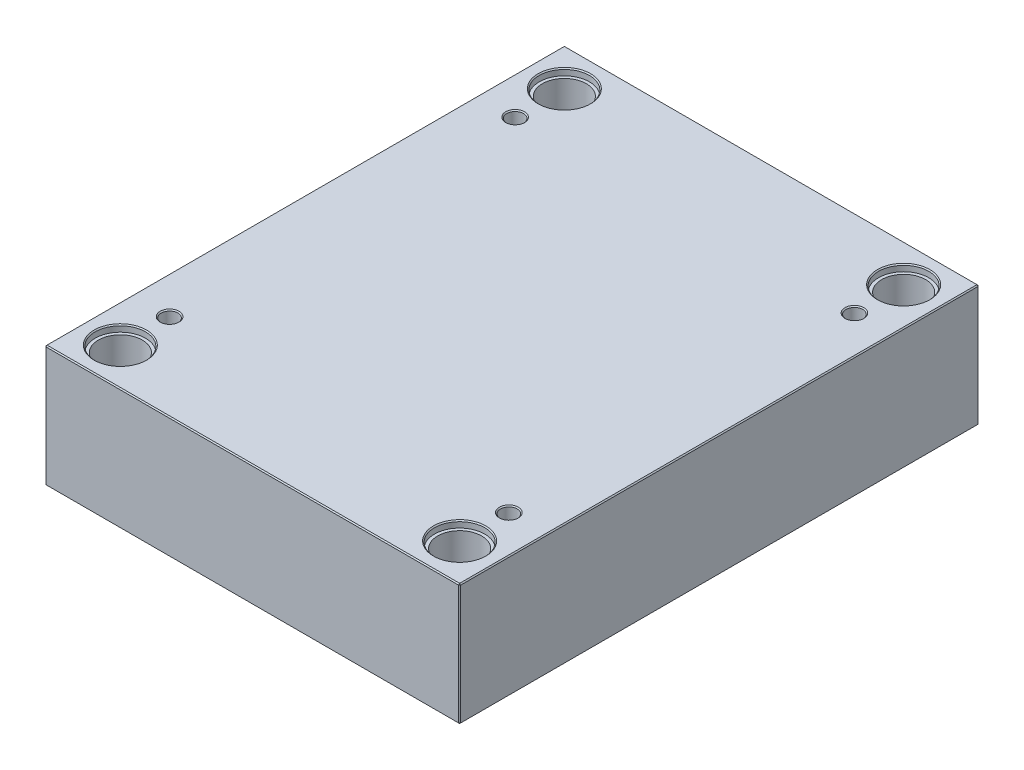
ISO-10303-21;
HEADER;
FILE_DESCRIPTION(('STEP AP214'),'2;1');
FILE_NAME('part.step','',(''),(''),'','','');
FILE_SCHEMA(('AUTOMOTIVE_DESIGN { 1 0 10303 214 1 1 1 1 }'));
ENDSEC;
DATA;
#1=APPLICATION_CONTEXT('core data for automotive mechanical design processes');
#2=APPLICATION_PROTOCOL_DEFINITION('international standard','automotive_design',2000,#1);
#3=PRODUCT_CONTEXT('',#1,'mechanical');
#4=PRODUCT('Part','Part','',(#3));
#5=PRODUCT_RELATED_PRODUCT_CATEGORY('part','',(#4));
#6=PRODUCT_DEFINITION_FORMATION('','',#4);
#7=PRODUCT_DEFINITION_CONTEXT('part definition',#1,'design');
#8=PRODUCT_DEFINITION('design','',#6,#7);
#9=PRODUCT_DEFINITION_SHAPE('','',#8);
#10=(LENGTH_UNIT() NAMED_UNIT(*) SI_UNIT(.MILLI.,.METRE.));
#11=(NAMED_UNIT(*) PLANE_ANGLE_UNIT() SI_UNIT($,.RADIAN.));
#12=(NAMED_UNIT(*) SI_UNIT($,.STERADIAN.) SOLID_ANGLE_UNIT());
#13=UNCERTAINTY_MEASURE_WITH_UNIT(LENGTH_MEASURE(1.E-05),#10,'distance_accuracy_value','');
#14=(GEOMETRIC_REPRESENTATION_CONTEXT(3) GLOBAL_UNCERTAINTY_ASSIGNED_CONTEXT((#13)) GLOBAL_UNIT_ASSIGNED_CONTEXT((#10,
#11,#12)) REPRESENTATION_CONTEXT('',''));
#15=CARTESIAN_POINT('',(0.,0.,0.));
#16=DIRECTION('',(0.,0.,1.));
#17=DIRECTION('',(1.,0.,0.));
#18=AXIS2_PLACEMENT_3D('',#15,#16,#17);
#19=CARTESIAN_POINT('',(-162.,0.,-212.));
#20=DIRECTION('',(0.,1.,0.));
#21=DIRECTION('',(0.,0.,1.));
#22=AXIS2_PLACEMENT_3D('',#19,#20,#21);
#23=CYLINDRICAL_SURFACE('',#22,21.);
#24=CARTESIAN_POINT('',(-162.,0.999999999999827,-212.));
#25=DIRECTION('',(0.,1.,0.));
#26=DIRECTION('',(0.,0.,1.));
#27=AXIS2_PLACEMENT_3D('',#24,#25,#26);
#28=CIRCLE('',#27,21.);
#29=CARTESIAN_POINT('',(-162.,0.999999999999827,-191.));
#30=VERTEX_POINT('',#29);
#31=EDGE_CURVE('E472',#30,#30,#28,.F.);
#32=ORIENTED_EDGE('',*,*,#31,.T.);
#33=EDGE_LOOP('',(#32));
#34=FACE_BOUND('',#33,.T.);
#35=CARTESIAN_POINT('',(-162.,109.7,-212.));
#36=DIRECTION('',(0.,1.,0.));
#37=DIRECTION('',(0.,0.,1.));
#38=AXIS2_PLACEMENT_3D('',#35,#36,#37);
#39=CIRCLE('',#38,21.);
#40=CARTESIAN_POINT('',(-162.,109.7,-191.));
#41=VERTEX_POINT('',#40);
#42=EDGE_CURVE('E221',#41,#41,#39,.F.);
#43=ORIENTED_EDGE('',*,*,#42,.F.);
#44=EDGE_LOOP('',(#43));
#45=FACE_BOUND('',#44,.T.);
#46=ADVANCED_FACE('F16',(#34,#45),#23,.F.);
#47=CARTESIAN_POINT('',(162.,0.,-212.));
#48=DIRECTION('',(0.,1.,0.));
#49=DIRECTION('',(0.,0.,1.));
#50=AXIS2_PLACEMENT_3D('',#47,#48,#49);
#51=CYLINDRICAL_SURFACE('',#50,21.);
#52=CARTESIAN_POINT('',(162.,0.999999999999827,-212.));
#53=DIRECTION('',(0.,1.,0.));
#54=DIRECTION('',(0.,0.,1.));
#55=AXIS2_PLACEMENT_3D('',#52,#53,#54);
#56=CIRCLE('',#55,21.);
#57=CARTESIAN_POINT('',(162.,0.999999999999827,-191.));
#58=VERTEX_POINT('',#57);
#59=EDGE_CURVE('E474',#58,#58,#56,.F.);
#60=ORIENTED_EDGE('',*,*,#59,.T.);
#61=EDGE_LOOP('',(#60));
#62=FACE_BOUND('',#61,.T.);
#63=CARTESIAN_POINT('',(162.,109.7,-212.));
#64=DIRECTION('',(0.,1.,0.));
#65=DIRECTION('',(0.,0.,1.));
#66=AXIS2_PLACEMENT_3D('',#63,#64,#65);
#67=CIRCLE('',#66,21.);
#68=CARTESIAN_POINT('',(162.,109.7,-191.));
#69=VERTEX_POINT('',#68);
#70=EDGE_CURVE('E218',#69,#69,#67,.F.);
#71=ORIENTED_EDGE('',*,*,#70,.F.);
#72=EDGE_LOOP('',(#71));
#73=FACE_BOUND('',#72,.T.);
#74=ADVANCED_FACE('F263',(#62,#73),#51,.F.);
#75=CARTESIAN_POINT('',(162.,0.,212.));
#76=DIRECTION('',(0.,1.,0.));
#77=DIRECTION('',(0.,0.,1.));
#78=AXIS2_PLACEMENT_3D('',#75,#76,#77);
#79=CYLINDRICAL_SURFACE('',#78,21.);
#80=CARTESIAN_POINT('',(162.,0.999999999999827,212.));
#81=DIRECTION('',(0.,1.,0.));
#82=DIRECTION('',(0.,0.,1.));
#83=AXIS2_PLACEMENT_3D('',#80,#81,#82);
#84=CIRCLE('',#83,21.);
#85=CARTESIAN_POINT('',(162.,0.999999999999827,233.));
#86=VERTEX_POINT('',#85);
#87=EDGE_CURVE('E477',#86,#86,#84,.F.);
#88=ORIENTED_EDGE('',*,*,#87,.T.);
#89=EDGE_LOOP('',(#88));
#90=FACE_BOUND('',#89,.T.);
#91=CARTESIAN_POINT('',(162.,109.7,212.));
#92=DIRECTION('',(0.,1.,0.));
#93=DIRECTION('',(0.,0.,1.));
#94=AXIS2_PLACEMENT_3D('',#91,#92,#93);
#95=CIRCLE('',#94,21.);
#96=CARTESIAN_POINT('',(162.,109.7,233.));
#97=VERTEX_POINT('',#96);
#98=EDGE_CURVE('E214',#97,#97,#95,.F.);
#99=ORIENTED_EDGE('',*,*,#98,.F.);
#100=EDGE_LOOP('',(#99));
#101=FACE_BOUND('',#100,.T.);
#102=ADVANCED_FACE('F270',(#90,#101),#79,.F.);
#103=CARTESIAN_POINT('',(-162.,0.,212.));
#104=DIRECTION('',(0.,1.,0.));
#105=DIRECTION('',(0.,0.,1.));
#106=AXIS2_PLACEMENT_3D('',#103,#104,#105);
#107=CYLINDRICAL_SURFACE('',#106,21.);
#108=CARTESIAN_POINT('',(-162.,0.999999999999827,212.));
#109=DIRECTION('',(0.,1.,0.));
#110=DIRECTION('',(0.,0.,1.));
#111=AXIS2_PLACEMENT_3D('',#108,#109,#110);
#112=CIRCLE('',#111,21.);
#113=CARTESIAN_POINT('',(-162.,0.999999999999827,233.));
#114=VERTEX_POINT('',#113);
#115=EDGE_CURVE('E480',#114,#114,#112,.F.);
#116=ORIENTED_EDGE('',*,*,#115,.T.);
#117=EDGE_LOOP('',(#116));
#118=FACE_BOUND('',#117,.T.);
#119=CARTESIAN_POINT('',(-162.,109.7,212.));
#120=DIRECTION('',(0.,1.,0.));
#121=DIRECTION('',(0.,0.,1.));
#122=AXIS2_PLACEMENT_3D('',#119,#120,#121);
#123=CIRCLE('',#122,21.);
#124=CARTESIAN_POINT('',(-162.,109.7,233.));
#125=VERTEX_POINT('',#124);
#126=EDGE_CURVE('E211',#125,#125,#123,.F.);
#127=ORIENTED_EDGE('',*,*,#126,.F.);
#128=EDGE_LOOP('',(#127));
#129=FACE_BOUND('',#128,.T.);
#130=ADVANCED_FACE('F277',(#118,#129),#107,.F.);
#131=CARTESIAN_POINT('',(-198.,116.,248.));
#132=DIRECTION('',(1.,0.,0.));
#133=DIRECTION('',(0.,0.,-1.));
#134=AXIS2_PLACEMENT_3D('',#131,#132,#133);
#135=PLANE('',#134);
#136=DIRECTION('',(0.,-1.,0.));
#137=VECTOR('',#136,1.);
#138=CARTESIAN_POINT('',(-198.,116.,-247.));
#139=LINE('',#138,#137);
#140=CARTESIAN_POINT('',(-198.,115.,-247.));
#141=VERTEX_POINT('',#140);
#142=CARTESIAN_POINT('',(-198.,1.00000000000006,-247.));
#143=VERTEX_POINT('',#142);
#144=EDGE_CURVE('E487',#141,#143,#139,.T.);
#145=ORIENTED_EDGE('',*,*,#144,.T.);
#146=DIRECTION('',(0.,0.,1.));
#147=VECTOR('',#146,1.);
#148=CARTESIAN_POINT('',(-198.,1.00000000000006,248.));
#149=LINE('',#148,#147);
#150=CARTESIAN_POINT('',(-198.,1.00000000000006,247.));
#151=VERTEX_POINT('',#150);
#152=EDGE_CURVE('E490',#143,#151,#149,.T.);
#153=ORIENTED_EDGE('',*,*,#152,.T.);
#154=DIRECTION('',(0.,1.,0.));
#155=VECTOR('',#154,1.);
#156=CARTESIAN_POINT('',(-198.,116.,247.));
#157=LINE('',#156,#155);
#158=CARTESIAN_POINT('',(-198.,115.,247.));
#159=VERTEX_POINT('',#158);
#160=EDGE_CURVE('E485',#151,#159,#157,.T.);
#161=ORIENTED_EDGE('',*,*,#160,.T.);
#162=DIRECTION('',(0.,0.,-1.));
#163=VECTOR('',#162,1.);
#164=CARTESIAN_POINT('',(-198.,115.,-248.));
#165=LINE('',#164,#163);
#166=EDGE_CURVE('E483',#159,#141,#165,.T.);
#167=ORIENTED_EDGE('',*,*,#166,.T.);
#168=EDGE_LOOP('',(#145,#153,#161,#167));
#169=FACE_BOUND('',#168,.T.);
#170=ADVANCED_FACE('F298',(#169),#135,.F.);
#171=CARTESIAN_POINT('',(198.,116.,248.));
#172=DIRECTION('',(0.,0.,-1.));
#173=DIRECTION('',(-1.,0.,0.));
#174=AXIS2_PLACEMENT_3D('',#171,#172,#173);
#175=PLANE('',#174);
#176=DIRECTION('',(-1.,0.,0.));
#177=VECTOR('',#176,1.);
#178=CARTESIAN_POINT('',(-198.,115.,248.));
#179=LINE('',#178,#177);
#180=CARTESIAN_POINT('',(197.,115.,248.));
#181=VERTEX_POINT('',#180);
#182=CARTESIAN_POINT('',(-197.,115.,248.));
#183=VERTEX_POINT('',#182);
#184=EDGE_CURVE('E509',#181,#183,#179,.T.);
#185=ORIENTED_EDGE('',*,*,#184,.T.);
#186=DIRECTION('',(0.,-1.,0.));
#187=VECTOR('',#186,1.);
#188=CARTESIAN_POINT('',(-197.,116.,248.));
#189=LINE('',#188,#187);
#190=CARTESIAN_POINT('',(-197.,1.00000000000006,248.));
#191=VERTEX_POINT('',#190);
#192=EDGE_CURVE('E515',#183,#191,#189,.T.);
#193=ORIENTED_EDGE('',*,*,#192,.T.);
#194=DIRECTION('',(1.,0.,0.));
#195=VECTOR('',#194,1.);
#196=CARTESIAN_POINT('',(198.,1.00000000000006,248.));
#197=LINE('',#196,#195);
#198=CARTESIAN_POINT('',(197.,1.00000000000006,248.));
#199=VERTEX_POINT('',#198);
#200=EDGE_CURVE('E513',#191,#199,#197,.T.);
#201=ORIENTED_EDGE('',*,*,#200,.T.);
#202=DIRECTION('',(0.,1.,0.));
#203=VECTOR('',#202,1.);
#204=CARTESIAN_POINT('',(197.,116.,248.));
#205=LINE('',#204,#203);
#206=EDGE_CURVE('E511',#199,#181,#205,.T.);
#207=ORIENTED_EDGE('',*,*,#206,.T.);
#208=EDGE_LOOP('',(#185,#193,#201,#207));
#209=FACE_BOUND('',#208,.T.);
#210=ADVANCED_FACE('F294',(#209),#175,.F.);
#211=CARTESIAN_POINT('',(198.,116.,248.));
#212=DIRECTION('',(-1.,0.,0.));
#213=DIRECTION('',(0.,0.,1.));
#214=AXIS2_PLACEMENT_3D('',#211,#212,#213);
#215=PLANE('',#214);
#216=DIRECTION('',(0.,0.,-1.));
#217=VECTOR('',#216,1.);
#218=CARTESIAN_POINT('',(198.,1.00000000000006,248.));
#219=LINE('',#218,#217);
#220=CARTESIAN_POINT('',(198.,1.00000000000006,247.));
#221=VERTEX_POINT('',#220);
#222=CARTESIAN_POINT('',(198.,1.00000000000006,-247.));
#223=VERTEX_POINT('',#222);
#224=EDGE_CURVE('E504',#221,#223,#219,.T.);
#225=ORIENTED_EDGE('',*,*,#224,.T.);
#226=DIRECTION('',(0.,1.,0.));
#227=VECTOR('',#226,1.);
#228=CARTESIAN_POINT('',(198.,116.,-247.));
#229=LINE('',#228,#227);
#230=CARTESIAN_POINT('',(198.,115.,-247.));
#231=VERTEX_POINT('',#230);
#232=EDGE_CURVE('E506',#223,#231,#229,.T.);
#233=ORIENTED_EDGE('',*,*,#232,.T.);
#234=DIRECTION('',(0.,0.,1.));
#235=VECTOR('',#234,1.);
#236=CARTESIAN_POINT('',(198.,115.,248.));
#237=LINE('',#236,#235);
#238=CARTESIAN_POINT('',(198.,115.,247.));
#239=VERTEX_POINT('',#238);
#240=EDGE_CURVE('E500',#231,#239,#237,.T.);
#241=ORIENTED_EDGE('',*,*,#240,.T.);
#242=DIRECTION('',(0.,-1.,0.));
#243=VECTOR('',#242,1.);
#244=CARTESIAN_POINT('',(198.,116.,247.));
#245=LINE('',#244,#243);
#246=EDGE_CURVE('E502',#239,#221,#245,.T.);
#247=ORIENTED_EDGE('',*,*,#246,.T.);
#248=EDGE_LOOP('',(#225,#233,#241,#247));
#249=FACE_BOUND('',#248,.T.);
#250=ADVANCED_FACE('F290',(#249),#215,.F.);
#251=CARTESIAN_POINT('',(198.,116.,-248.));
#252=DIRECTION('',(0.,0.,1.));
#253=DIRECTION('',(1.,0.,0.));
#254=AXIS2_PLACEMENT_3D('',#251,#252,#253);
#255=PLANE('',#254);
#256=DIRECTION('',(0.,-1.,0.));
#257=VECTOR('',#256,1.);
#258=CARTESIAN_POINT('',(197.,116.,-248.));
#259=LINE('',#258,#257);
#260=CARTESIAN_POINT('',(197.,115.,-248.));
#261=VERTEX_POINT('',#260);
#262=CARTESIAN_POINT('',(197.,1.00000000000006,-248.));
#263=VERTEX_POINT('',#262);
#264=EDGE_CURVE('E494',#261,#263,#259,.T.);
#265=ORIENTED_EDGE('',*,*,#264,.T.);
#266=DIRECTION('',(-1.,0.,0.));
#267=VECTOR('',#266,1.);
#268=CARTESIAN_POINT('',(198.,1.00000000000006,-248.));
#269=LINE('',#268,#267);
#270=CARTESIAN_POINT('',(-197.,1.00000000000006,-248.));
#271=VERTEX_POINT('',#270);
#272=EDGE_CURVE('E138',#263,#271,#269,.T.);
#273=ORIENTED_EDGE('',*,*,#272,.T.);
#274=DIRECTION('',(0.,1.,0.));
#275=VECTOR('',#274,1.);
#276=CARTESIAN_POINT('',(-197.,116.,-248.));
#277=LINE('',#276,#275);
#278=CARTESIAN_POINT('',(-197.,115.,-248.));
#279=VERTEX_POINT('',#278);
#280=EDGE_CURVE('E496',#271,#279,#277,.T.);
#281=ORIENTED_EDGE('',*,*,#280,.T.);
#282=DIRECTION('',(1.,0.,0.));
#283=VECTOR('',#282,1.);
#284=CARTESIAN_POINT('',(198.,115.,-248.));
#285=LINE('',#284,#283);
#286=EDGE_CURVE('E492',#279,#261,#285,.T.);
#287=ORIENTED_EDGE('',*,*,#286,.T.);
#288=EDGE_LOOP('',(#265,#273,#281,#287));
#289=FACE_BOUND('',#288,.T.);
#290=ADVANCED_FACE('F282',(#289),#255,.F.);
#291=CARTESIAN_POINT('',(0.,116.,0.));
#292=DIRECTION('',(0.,1.,0.));
#293=DIRECTION('',(0.,0.,1.));
#294=AXIS2_PLACEMENT_3D('',#291,#292,#293);
#295=PLANE('',#294);
#296=CARTESIAN_POINT('',(162.,116.,212.));
#297=DIRECTION('',(0.,1.,0.));
#298=DIRECTION('',(0.,0.,1.));
#299=AXIS2_PLACEMENT_3D('',#296,#297,#298);
#300=CIRCLE('',#299,25.);
#301=CARTESIAN_POINT('',(162.,116.,237.));
#302=VERTEX_POINT('',#301);
#303=EDGE_CURVE('E236',#302,#302,#300,.F.);
#304=ORIENTED_EDGE('',*,*,#303,.T.);
#305=EDGE_LOOP('',(#304));
#306=FACE_BOUND('',#305,.T.);
#307=CARTESIAN_POINT('',(-162.,116.,212.));
#308=DIRECTION('',(0.,1.,0.));
#309=DIRECTION('',(0.,0.,1.));
#310=AXIS2_PLACEMENT_3D('',#307,#308,#309);
#311=CIRCLE('',#310,25.);
#312=CARTESIAN_POINT('',(-162.,116.,237.));
#313=VERTEX_POINT('',#312);
#314=EDGE_CURVE('E233',#313,#313,#311,.F.);
#315=ORIENTED_EDGE('',*,*,#314,.T.);
#316=EDGE_LOOP('',(#315));
#317=FACE_BOUND('',#316,.T.);
#318=CARTESIAN_POINT('',(162.,116.,-212.));
#319=DIRECTION('',(0.,1.,0.));
#320=DIRECTION('',(0.,0.,1.));
#321=AXIS2_PLACEMENT_3D('',#318,#319,#320);
#322=CIRCLE('',#321,25.);
#323=CARTESIAN_POINT('',(162.,116.,-187.));
#324=VERTEX_POINT('',#323);
#325=EDGE_CURVE('E230',#324,#324,#322,.F.);
#326=ORIENTED_EDGE('',*,*,#325,.T.);
#327=EDGE_LOOP('',(#326));
#328=FACE_BOUND('',#327,.T.);
#329=CARTESIAN_POINT('',(-162.,116.,-212.));
#330=DIRECTION('',(0.,1.,0.));
#331=DIRECTION('',(0.,0.,1.));
#332=AXIS2_PLACEMENT_3D('',#329,#330,#331);
#333=CIRCLE('',#332,25.);
#334=CARTESIAN_POINT('',(-162.,116.,-187.));
#335=VERTEX_POINT('',#334);
#336=EDGE_CURVE('E227',#335,#335,#333,.F.);
#337=ORIENTED_EDGE('',*,*,#336,.T.);
#338=EDGE_LOOP('',(#337));
#339=FACE_BOUND('',#338,.T.);
#340=CARTESIAN_POINT('',(-162.,116.,165.));
#341=DIRECTION('',(0.,1.,0.));
#342=DIRECTION('',(0.,0.,1.));
#343=AXIS2_PLACEMENT_3D('',#340,#341,#342);
#344=CIRCLE('',#343,9.);
#345=CARTESIAN_POINT('',(-162.,116.,174.));
#346=VERTEX_POINT('',#345);
#347=EDGE_CURVE('E198',#346,#346,#344,.F.);
#348=ORIENTED_EDGE('',*,*,#347,.T.);
#349=EDGE_LOOP('',(#348));
#350=FACE_BOUND('',#349,.T.);
#351=CARTESIAN_POINT('',(162.,116.,165.));
#352=DIRECTION('',(0.,1.,0.));
#353=DIRECTION('',(0.,0.,1.));
#354=AXIS2_PLACEMENT_3D('',#351,#352,#353);
#355=CIRCLE('',#354,9.);
#356=CARTESIAN_POINT('',(162.,116.,174.));
#357=VERTEX_POINT('',#356);
#358=EDGE_CURVE('E195',#357,#357,#355,.F.);
#359=ORIENTED_EDGE('',*,*,#358,.T.);
#360=EDGE_LOOP('',(#359));
#361=FACE_BOUND('',#360,.T.);
#362=CARTESIAN_POINT('',(162.,116.,-165.));
#363=DIRECTION('',(0.,1.,0.));
#364=DIRECTION('',(0.,0.,1.));
#365=AXIS2_PLACEMENT_3D('',#362,#363,#364);
#366=CIRCLE('',#365,9.);
#367=CARTESIAN_POINT('',(162.,116.,-156.));
#368=VERTEX_POINT('',#367);
#369=EDGE_CURVE('E192',#368,#368,#366,.F.);
#370=ORIENTED_EDGE('',*,*,#369,.T.);
#371=EDGE_LOOP('',(#370));
#372=FACE_BOUND('',#371,.T.);
#373=CARTESIAN_POINT('',(-162.,116.,-165.));
#374=DIRECTION('',(0.,1.,0.));
#375=DIRECTION('',(0.,0.,1.));
#376=AXIS2_PLACEMENT_3D('',#373,#374,#375);
#377=CIRCLE('',#376,9.);
#378=CARTESIAN_POINT('',(-162.,116.,-156.));
#379=VERTEX_POINT('',#378);
#380=EDGE_CURVE('E188',#379,#379,#377,.F.);
#381=ORIENTED_EDGE('',*,*,#380,.T.);
#382=EDGE_LOOP('',(#381));
#383=FACE_BOUND('',#382,.T.);
#384=DIRECTION('',(0.,0.,-1.));
#385=VECTOR('',#384,1.);
#386=CARTESIAN_POINT('',(197.,116.,-248.));
#387=LINE('',#386,#385);
#388=CARTESIAN_POINT('',(197.,116.,247.));
#389=VERTEX_POINT('',#388);
#390=CARTESIAN_POINT('',(197.,116.,-247.));
#391=VERTEX_POINT('',#390);
#392=EDGE_CURVE('E31',#389,#391,#387,.T.);
#393=ORIENTED_EDGE('',*,*,#392,.T.);
#394=DIRECTION('',(-1.,0.,0.));
#395=VECTOR('',#394,1.);
#396=CARTESIAN_POINT('',(-198.,116.,-247.));
#397=LINE('',#396,#395);
#398=CARTESIAN_POINT('',(-197.,116.,-247.));
#399=VERTEX_POINT('',#398);
#400=EDGE_CURVE('E189',#391,#399,#397,.T.);
#401=ORIENTED_EDGE('',*,*,#400,.T.);
#402=DIRECTION('',(0.,0.,1.));
#403=VECTOR('',#402,1.);
#404=CARTESIAN_POINT('',(-197.,116.,248.));
#405=LINE('',#404,#403);
#406=CARTESIAN_POINT('',(-197.,116.,247.));
#407=VERTEX_POINT('',#406);
#408=EDGE_CURVE('E518',#399,#407,#405,.T.);
#409=ORIENTED_EDGE('',*,*,#408,.T.);
#410=DIRECTION('',(1.,0.,0.));
#411=VECTOR('',#410,1.);
#412=CARTESIAN_POINT('',(198.,116.,247.));
#413=LINE('',#412,#411);
#414=EDGE_CURVE('E36',#407,#389,#413,.T.);
#415=ORIENTED_EDGE('',*,*,#414,.T.);
#416=EDGE_LOOP('',(#393,#401,#409,#415));
#417=FACE_BOUND('',#416,.T.);
#418=ADVANCED_FACE('F279',(#306,#317,#328,#339,#350,#361,#372,#383,#417),#295,.T.);
#419=CARTESIAN_POINT('',(0.,0.,0.));
#420=DIRECTION('',(0.,1.,0.));
#421=DIRECTION('',(0.,0.,1.));
#422=AXIS2_PLACEMENT_3D('',#419,#420,#421);
#423=PLANE('',#422);
#424=CARTESIAN_POINT('',(-162.,0.,-212.));
#425=DIRECTION('',(0.,1.,0.));
#426=DIRECTION('',(0.,0.,1.));
#427=AXIS2_PLACEMENT_3D('',#424,#425,#426);
#428=CIRCLE('',#427,22.);
#429=CARTESIAN_POINT('',(-162.,0.,-190.));
#430=VERTEX_POINT('',#429);
#431=EDGE_CURVE('E469',#430,#430,#428,.T.);
#432=ORIENTED_EDGE('',*,*,#431,.T.);
#433=EDGE_LOOP('',(#432));
#434=FACE_BOUND('',#433,.T.);
#435=CARTESIAN_POINT('',(162.,0.,-212.));
#436=DIRECTION('',(0.,1.,0.));
#437=DIRECTION('',(0.,0.,1.));
#438=AXIS2_PLACEMENT_3D('',#435,#436,#437);
#439=CIRCLE('',#438,22.);
#440=CARTESIAN_POINT('',(162.,0.,-190.));
#441=VERTEX_POINT('',#440);
#442=EDGE_CURVE('E466',#441,#441,#439,.T.);
#443=ORIENTED_EDGE('',*,*,#442,.T.);
#444=EDGE_LOOP('',(#443));
#445=FACE_BOUND('',#444,.T.);
#446=CARTESIAN_POINT('',(162.,0.,212.));
#447=DIRECTION('',(0.,1.,0.));
#448=DIRECTION('',(0.,0.,1.));
#449=AXIS2_PLACEMENT_3D('',#446,#447,#448);
#450=CIRCLE('',#449,22.);
#451=CARTESIAN_POINT('',(162.,0.,234.));
#452=VERTEX_POINT('',#451);
#453=EDGE_CURVE('E463',#452,#452,#450,.T.);
#454=ORIENTED_EDGE('',*,*,#453,.T.);
#455=EDGE_LOOP('',(#454));
#456=FACE_BOUND('',#455,.T.);
#457=CARTESIAN_POINT('',(-162.,0.,212.));
#458=DIRECTION('',(0.,1.,0.));
#459=DIRECTION('',(0.,0.,1.));
#460=AXIS2_PLACEMENT_3D('',#457,#458,#459);
#461=CIRCLE('',#460,22.);
#462=CARTESIAN_POINT('',(-162.,0.,234.));
#463=VERTEX_POINT('',#462);
#464=EDGE_CURVE('E460',#463,#463,#461,.T.);
#465=ORIENTED_EDGE('',*,*,#464,.T.);
#466=EDGE_LOOP('',(#465));
#467=FACE_BOUND('',#466,.T.);
#468=DIRECTION('',(0.,0.,1.));
#469=VECTOR('',#468,1.);
#470=CARTESIAN_POINT('',(197.,0.,0.));
#471=LINE('',#470,#469);
#472=CARTESIAN_POINT('',(197.,0.,-247.));
#473=VERTEX_POINT('',#472);
#474=CARTESIAN_POINT('',(197.,0.,247.));
#475=VERTEX_POINT('',#474);
#476=EDGE_CURVE('E108',#473,#475,#471,.T.);
#477=ORIENTED_EDGE('',*,*,#476,.T.);
#478=DIRECTION('',(-1.,0.,0.));
#479=VECTOR('',#478,1.);
#480=CARTESIAN_POINT('',(0.,0.,247.));
#481=LINE('',#480,#479);
#482=CARTESIAN_POINT('',(-197.,0.,247.));
#483=VERTEX_POINT('',#482);
#484=EDGE_CURVE('E458',#475,#483,#481,.T.);
#485=ORIENTED_EDGE('',*,*,#484,.T.);
#486=DIRECTION('',(0.,0.,-1.));
#487=VECTOR('',#486,1.);
#488=CARTESIAN_POINT('',(-197.,0.,0.));
#489=LINE('',#488,#487);
#490=CARTESIAN_POINT('',(-197.,0.,-247.));
#491=VERTEX_POINT('',#490);
#492=EDGE_CURVE('E110',#483,#491,#489,.T.);
#493=ORIENTED_EDGE('',*,*,#492,.T.);
#494=DIRECTION('',(1.,0.,0.));
#495=VECTOR('',#494,1.);
#496=CARTESIAN_POINT('',(0.,0.,-247.));
#497=LINE('',#496,#495);
#498=EDGE_CURVE('E104',#491,#473,#497,.T.);
#499=ORIENTED_EDGE('',*,*,#498,.T.);
#500=EDGE_LOOP('',(#477,#485,#493,#499));
#501=FACE_BOUND('',#500,.T.);
#502=ADVANCED_FACE('F106',(#434,#445,#456,#467,#501),#423,.F.);
#503=CARTESIAN_POINT('',(-162.,0.,-212.));
#504=DIRECTION('',(0.,-1.,0.));
#505=DIRECTION('',(0.,0.,-1.));
#506=AXIS2_PLACEMENT_3D('',#503,#504,#505);
#507=CONICAL_SURFACE('',#506,22.,0.785398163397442);
#508=ORIENTED_EDGE('',*,*,#31,.F.);
#509=EDGE_LOOP('',(#508));
#510=FACE_BOUND('',#509,.T.);
#511=ORIENTED_EDGE('',*,*,#431,.F.);
#512=EDGE_LOOP('',(#511));
#513=FACE_BOUND('',#512,.T.);
#514=ADVANCED_FACE('F286',(#510,#513),#507,.F.);
#515=CARTESIAN_POINT('',(162.,0.,-212.));
#516=DIRECTION('',(0.,-1.,0.));
#517=DIRECTION('',(0.,0.,-1.));
#518=AXIS2_PLACEMENT_3D('',#515,#516,#517);
#519=CONICAL_SURFACE('',#518,22.,0.785398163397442);
#520=ORIENTED_EDGE('',*,*,#59,.F.);
#521=EDGE_LOOP('',(#520));
#522=FACE_BOUND('',#521,.T.);
#523=ORIENTED_EDGE('',*,*,#442,.F.);
#524=EDGE_LOOP('',(#523));
#525=FACE_BOUND('',#524,.T.);
#526=ADVANCED_FACE('F305',(#522,#525),#519,.F.);
#527=CARTESIAN_POINT('',(162.,0.,212.));
#528=DIRECTION('',(0.,-1.,0.));
#529=DIRECTION('',(0.,0.,-1.));
#530=AXIS2_PLACEMENT_3D('',#527,#528,#529);
#531=CONICAL_SURFACE('',#530,22.,0.785398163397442);
#532=ORIENTED_EDGE('',*,*,#87,.F.);
#533=EDGE_LOOP('',(#532));
#534=FACE_BOUND('',#533,.T.);
#535=ORIENTED_EDGE('',*,*,#453,.F.);
#536=EDGE_LOOP('',(#535));
#537=FACE_BOUND('',#536,.T.);
#538=ADVANCED_FACE('F309',(#534,#537),#531,.F.);
#539=CARTESIAN_POINT('',(-162.,0.,212.));
#540=DIRECTION('',(0.,-1.,0.));
#541=DIRECTION('',(0.,0.,-1.));
#542=AXIS2_PLACEMENT_3D('',#539,#540,#541);
#543=CONICAL_SURFACE('',#542,22.,0.785398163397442);
#544=ORIENTED_EDGE('',*,*,#115,.F.);
#545=EDGE_LOOP('',(#544));
#546=FACE_BOUND('',#545,.T.);
#547=ORIENTED_EDGE('',*,*,#464,.F.);
#548=EDGE_LOOP('',(#547));
#549=FACE_BOUND('',#548,.T.);
#550=ADVANCED_FACE('F313',(#546,#549),#543,.F.);
#551=CARTESIAN_POINT('',(198.,116.,247.));
#552=DIRECTION('',(-0.707106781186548,0.,-0.707106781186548));
#553=DIRECTION('',(0.,-1.,0.));
#554=AXIS2_PLACEMENT_3D('',#551,#552,#553);
#555=PLANE('',#554);
#556=DIRECTION('',(-0.707106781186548,0.,0.707106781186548));
#557=VECTOR('',#556,1.);
#558=CARTESIAN_POINT('',(197.,115.,248.));
#559=LINE('',#558,#557);
#560=EDGE_CURVE('E126',#181,#239,#559,.F.);
#561=ORIENTED_EDGE('',*,*,#560,.F.);
#562=ORIENTED_EDGE('',*,*,#206,.F.);
#563=DIRECTION('',(0.707106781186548,0.,-0.707106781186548));
#564=VECTOR('',#563,1.);
#565=CARTESIAN_POINT('',(197.,1.00000000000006,248.));
#566=LINE('',#565,#564);
#567=EDGE_CURVE('E180',#221,#199,#566,.F.);
#568=ORIENTED_EDGE('',*,*,#567,.F.);
#569=ORIENTED_EDGE('',*,*,#246,.F.);
#570=EDGE_LOOP('',(#561,#562,#568,#569));
#571=FACE_BOUND('',#570,.T.);
#572=ADVANCED_FACE('F317',(#571),#555,.F.);
#573=CARTESIAN_POINT('',(197.,115.,248.));
#574=DIRECTION('',(0.577350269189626,0.577350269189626,0.577350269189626));
#575=DIRECTION('',(0.707106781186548,0.,-0.707106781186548));
#576=AXIS2_PLACEMENT_3D('',#573,#574,#575);
#577=PLANE('',#576);
#578=DIRECTION('',(0.,-0.707106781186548,0.707106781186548));
#579=VECTOR('',#578,1.);
#580=CARTESIAN_POINT('',(197.,115.,248.));
#581=LINE('',#580,#579);
#582=EDGE_CURVE('E175',#181,#389,#581,.F.);
#583=ORIENTED_EDGE('',*,*,#582,.F.);
#584=ORIENTED_EDGE('',*,*,#560,.T.);
#585=DIRECTION('',(-0.707106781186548,0.707106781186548,0.));
#586=VECTOR('',#585,1.);
#587=CARTESIAN_POINT('',(197.5,115.5,247.));
#588=LINE('',#587,#586);
#589=EDGE_CURVE('E177',#389,#239,#588,.F.);
#590=ORIENTED_EDGE('',*,*,#589,.F.);
#591=EDGE_LOOP('',(#583,#584,#590));
#592=FACE_BOUND('',#591,.T.);
#593=ADVANCED_FACE('F385',(#592),#577,.T.);
#594=CARTESIAN_POINT('',(197.,1.00000000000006,248.));
#595=DIRECTION('',(0.577350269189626,-0.577350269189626,0.577350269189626));
#596=DIRECTION('',(0.707106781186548,0.,-0.707106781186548));
#597=AXIS2_PLACEMENT_3D('',#594,#595,#596);
#598=PLANE('',#597);
#599=DIRECTION('',(-0.707106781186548,-0.707106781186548,0.));
#600=VECTOR('',#599,1.);
#601=CARTESIAN_POINT('',(197.5,0.500000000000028,247.));
#602=LINE('',#601,#600);
#603=EDGE_CURVE('E124',#221,#475,#602,.T.);
#604=ORIENTED_EDGE('',*,*,#603,.F.);
#605=ORIENTED_EDGE('',*,*,#567,.T.);
#606=DIRECTION('',(0.,0.707106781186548,0.707106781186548));
#607=VECTOR('',#606,1.);
#608=CARTESIAN_POINT('',(197.,1.00000000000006,248.));
#609=LINE('',#608,#607);
#610=EDGE_CURVE('E172',#475,#199,#609,.T.);
#611=ORIENTED_EDGE('',*,*,#610,.F.);
#612=EDGE_LOOP('',(#604,#605,#611));
#613=FACE_BOUND('',#612,.T.);
#614=ADVANCED_FACE('F381',(#613),#598,.T.);
#615=CARTESIAN_POINT('',(197.,116.,0.));
#616=DIRECTION('',(0.707106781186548,0.707106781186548,0.));
#617=DIRECTION('',(0.,0.,1.));
#618=AXIS2_PLACEMENT_3D('',#615,#616,#617);
#619=PLANE('',#618);
#620=ORIENTED_EDGE('',*,*,#589,.T.);
#621=ORIENTED_EDGE('',*,*,#240,.F.);
#622=DIRECTION('',(0.707106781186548,-0.707106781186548,0.));
#623=VECTOR('',#622,1.);
#624=CARTESIAN_POINT('',(198.,115.,-247.));
#625=LINE('',#624,#623);
#626=EDGE_CURVE('E166',#391,#231,#625,.T.);
#627=ORIENTED_EDGE('',*,*,#626,.F.);
#628=ORIENTED_EDGE('',*,*,#392,.F.);
#629=EDGE_LOOP('',(#620,#621,#627,#628));
#630=FACE_BOUND('',#629,.T.);
#631=ADVANCED_FACE('F377',(#630),#619,.T.);
#632=CARTESIAN_POINT('',(0.,116.,247.));
#633=DIRECTION('',(0.,0.707106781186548,0.707106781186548));
#634=DIRECTION('',(-1.,0.,0.));
#635=AXIS2_PLACEMENT_3D('',#632,#633,#634);
#636=PLANE('',#635);
#637=ORIENTED_EDGE('',*,*,#582,.T.);
#638=ORIENTED_EDGE('',*,*,#414,.F.);
#639=DIRECTION('',(0.,0.707106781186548,-0.707106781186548));
#640=VECTOR('',#639,1.);
#641=CARTESIAN_POINT('',(-197.,115.5,247.5));
#642=LINE('',#641,#640);
#643=EDGE_CURVE('E163',#183,#407,#642,.T.);
#644=ORIENTED_EDGE('',*,*,#643,.F.);
#645=ORIENTED_EDGE('',*,*,#184,.F.);
#646=EDGE_LOOP('',(#637,#638,#644,#645));
#647=FACE_BOUND('',#646,.T.);
#648=ADVANCED_FACE('F373',(#647),#636,.T.);
#649=CARTESIAN_POINT('',(-197.,116.,248.));
#650=DIRECTION('',(0.707106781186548,0.,-0.707106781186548));
#651=DIRECTION('',(0.,-1.,0.));
#652=AXIS2_PLACEMENT_3D('',#649,#650,#651);
#653=PLANE('',#652);
#654=DIRECTION('',(0.707106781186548,0.,0.707106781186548));
#655=VECTOR('',#654,1.);
#656=CARTESIAN_POINT('',(-197.,1.00000000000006,248.));
#657=LINE('',#656,#655);
#658=EDGE_CURVE('E157',#191,#151,#657,.F.);
#659=ORIENTED_EDGE('',*,*,#658,.F.);
#660=ORIENTED_EDGE('',*,*,#192,.F.);
#661=DIRECTION('',(-0.707106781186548,0.,-0.707106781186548));
#662=VECTOR('',#661,1.);
#663=CARTESIAN_POINT('',(-198.,115.,247.));
#664=LINE('',#663,#662);
#665=EDGE_CURVE('E160',#159,#183,#664,.F.);
#666=ORIENTED_EDGE('',*,*,#665,.F.);
#667=ORIENTED_EDGE('',*,*,#160,.F.);
#668=EDGE_LOOP('',(#659,#660,#666,#667));
#669=FACE_BOUND('',#668,.T.);
#670=ADVANCED_FACE('F369',(#669),#653,.F.);
#671=CARTESIAN_POINT('',(198.,1.00000000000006,248.));
#672=DIRECTION('',(0.,0.707106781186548,-0.707106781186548));
#673=DIRECTION('',(1.,0.,0.));
#674=AXIS2_PLACEMENT_3D('',#671,#672,#673);
#675=PLANE('',#674);
#676=ORIENTED_EDGE('',*,*,#610,.T.);
#677=ORIENTED_EDGE('',*,*,#200,.F.);
#678=DIRECTION('',(0.,-0.707106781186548,-0.707106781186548));
#679=VECTOR('',#678,1.);
#680=CARTESIAN_POINT('',(-197.,1.00000000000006,248.));
#681=LINE('',#680,#679);
#682=EDGE_CURVE('E135',#483,#191,#681,.F.);
#683=ORIENTED_EDGE('',*,*,#682,.F.);
#684=ORIENTED_EDGE('',*,*,#484,.F.);
#685=EDGE_LOOP('',(#676,#677,#683,#684));
#686=FACE_BOUND('',#685,.T.);
#687=ADVANCED_FACE('F366',(#686),#675,.F.);
#688=CARTESIAN_POINT('',(198.,1.00000000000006,248.));
#689=DIRECTION('',(-0.707106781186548,0.707106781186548,0.));
#690=DIRECTION('',(0.,0.,-1.));
#691=AXIS2_PLACEMENT_3D('',#688,#689,#690);
#692=PLANE('',#691);
#693=ORIENTED_EDGE('',*,*,#603,.T.);
#694=ORIENTED_EDGE('',*,*,#476,.F.);
#695=DIRECTION('',(0.707106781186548,0.707106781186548,0.));
#696=VECTOR('',#695,1.);
#697=CARTESIAN_POINT('',(197.5,0.500000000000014,-247.));
#698=LINE('',#697,#696);
#699=EDGE_CURVE('E121',#223,#473,#698,.F.);
#700=ORIENTED_EDGE('',*,*,#699,.F.);
#701=ORIENTED_EDGE('',*,*,#224,.F.);
#702=EDGE_LOOP('',(#693,#694,#700,#701));
#703=FACE_BOUND('',#702,.T.);
#704=ADVANCED_FACE('F119',(#703),#692,.F.);
#705=CARTESIAN_POINT('',(197.,116.,-248.));
#706=DIRECTION('',(-0.707106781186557,0.,0.707106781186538));
#707=DIRECTION('',(0.,-1.,0.));
#708=AXIS2_PLACEMENT_3D('',#705,#706,#707);
#709=PLANE('',#708);
#710=DIRECTION('',(0.707106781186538,0.,0.707106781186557));
#711=VECTOR('',#710,1.);
#712=CARTESIAN_POINT('',(198.,115.,-247.));
#713=LINE('',#712,#711);
#714=EDGE_CURVE('E168',#231,#261,#713,.F.);
#715=ORIENTED_EDGE('',*,*,#714,.F.);
#716=ORIENTED_EDGE('',*,*,#232,.F.);
#717=DIRECTION('',(-0.707106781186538,0.,-0.707106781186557));
#718=VECTOR('',#717,1.);
#719=CARTESIAN_POINT('',(197.,1.00000000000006,-248.));
#720=LINE('',#719,#718);
#721=EDGE_CURVE('E134',#263,#223,#720,.F.);
#722=ORIENTED_EDGE('',*,*,#721,.F.);
#723=ORIENTED_EDGE('',*,*,#264,.F.);
#724=EDGE_LOOP('',(#715,#716,#722,#723));
#725=FACE_BOUND('',#724,.T.);
#726=ADVANCED_FACE('F359',(#725),#709,.F.);
#727=CARTESIAN_POINT('',(198.,115.,-247.));
#728=DIRECTION('',(0.577350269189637,0.57735026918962,-0.57735026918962));
#729=DIRECTION('',(-0.707106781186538,0.,-0.707106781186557));
#730=AXIS2_PLACEMENT_3D('',#727,#728,#729);
#731=PLANE('',#730);
#732=ORIENTED_EDGE('',*,*,#626,.T.);
#733=ORIENTED_EDGE('',*,*,#714,.T.);
#734=DIRECTION('',(0.,0.707106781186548,0.707106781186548));
#735=VECTOR('',#734,1.);
#736=CARTESIAN_POINT('',(197.,115.5,-247.5));
#737=LINE('',#736,#735);
#738=EDGE_CURVE('E152',#391,#261,#737,.F.);
#739=ORIENTED_EDGE('',*,*,#738,.F.);
#740=EDGE_LOOP('',(#732,#733,#739));
#741=FACE_BOUND('',#740,.T.);
#742=ADVANCED_FACE('F355',(#741),#731,.T.);
#743=CARTESIAN_POINT('',(-198.,115.,247.));
#744=DIRECTION('',(-0.577350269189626,0.577350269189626,0.577350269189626));
#745=DIRECTION('',(0.707106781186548,0.,0.707106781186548));
#746=AXIS2_PLACEMENT_3D('',#743,#744,#745);
#747=PLANE('',#746);
#748=ORIENTED_EDGE('',*,*,#665,.T.);
#749=ORIENTED_EDGE('',*,*,#643,.T.);
#750=DIRECTION('',(-0.707106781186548,-0.707106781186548,0.));
#751=VECTOR('',#750,1.);
#752=CARTESIAN_POINT('',(-198.,115.,247.));
#753=LINE('',#752,#751);
#754=EDGE_CURVE('E143',#159,#407,#753,.F.);
#755=ORIENTED_EDGE('',*,*,#754,.F.);
#756=EDGE_LOOP('',(#748,#749,#755));
#757=FACE_BOUND('',#756,.T.);
#758=ADVANCED_FACE('F351',(#757),#747,.T.);
#759=CARTESIAN_POINT('',(-197.,1.00000000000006,248.));
#760=DIRECTION('',(-0.577350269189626,-0.577350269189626,0.577350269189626));
#761=DIRECTION('',(0.707106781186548,0.,0.707106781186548));
#762=AXIS2_PLACEMENT_3D('',#759,#760,#761);
#763=PLANE('',#762);
#764=ORIENTED_EDGE('',*,*,#682,.T.);
#765=ORIENTED_EDGE('',*,*,#658,.T.);
#766=DIRECTION('',(-0.707106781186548,0.707106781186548,0.));
#767=VECTOR('',#766,1.);
#768=CARTESIAN_POINT('',(-197.5,0.500000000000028,247.));
#769=LINE('',#768,#767);
#770=EDGE_CURVE('E139',#483,#151,#769,.T.);
#771=ORIENTED_EDGE('',*,*,#770,.F.);
#772=EDGE_LOOP('',(#764,#765,#771));
#773=FACE_BOUND('',#772,.T.);
#774=ADVANCED_FACE('F348',(#773),#763,.T.);
#775=CARTESIAN_POINT('',(197.,1.00000000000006,-248.));
#776=DIRECTION('',(0.577350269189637,-0.57735026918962,-0.57735026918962));
#777=DIRECTION('',(-0.707106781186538,0.,-0.707106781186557));
#778=AXIS2_PLACEMENT_3D('',#775,#776,#777);
#779=PLANE('',#778);
#780=ORIENTED_EDGE('',*,*,#721,.T.);
#781=ORIENTED_EDGE('',*,*,#699,.T.);
#782=DIRECTION('',(0.,-0.707106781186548,0.707106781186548));
#783=VECTOR('',#782,1.);
#784=CARTESIAN_POINT('',(197.,1.00000000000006,-248.));
#785=LINE('',#784,#783);
#786=EDGE_CURVE('E131',#263,#473,#785,.T.);
#787=ORIENTED_EDGE('',*,*,#786,.F.);
#788=EDGE_LOOP('',(#780,#781,#787));
#789=FACE_BOUND('',#788,.T.);
#790=ADVANCED_FACE('F130',(#789),#779,.T.);
#791=CARTESIAN_POINT('',(0.,116.,-247.));
#792=DIRECTION('',(0.,0.707106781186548,-0.707106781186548));
#793=DIRECTION('',(1.,0.,0.));
#794=AXIS2_PLACEMENT_3D('',#791,#792,#793);
#795=PLANE('',#794);
#796=ORIENTED_EDGE('',*,*,#738,.T.);
#797=ORIENTED_EDGE('',*,*,#286,.F.);
#798=DIRECTION('',(0.,-0.707106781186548,-0.707106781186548));
#799=VECTOR('',#798,1.);
#800=CARTESIAN_POINT('',(-197.,115.,-248.));
#801=LINE('',#800,#799);
#802=EDGE_CURVE('E140',#399,#279,#801,.T.);
#803=ORIENTED_EDGE('',*,*,#802,.F.);
#804=ORIENTED_EDGE('',*,*,#400,.F.);
#805=EDGE_LOOP('',(#796,#797,#803,#804));
#806=FACE_BOUND('',#805,.T.);
#807=ADVANCED_FACE('F341',(#806),#795,.T.);
#808=CARTESIAN_POINT('',(-197.,116.,0.));
#809=DIRECTION('',(-0.707106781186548,0.707106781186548,0.));
#810=DIRECTION('',(0.,0.,-1.));
#811=AXIS2_PLACEMENT_3D('',#808,#809,#810);
#812=PLANE('',#811);
#813=ORIENTED_EDGE('',*,*,#754,.T.);
#814=ORIENTED_EDGE('',*,*,#408,.F.);
#815=DIRECTION('',(0.707106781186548,0.707106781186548,0.));
#816=VECTOR('',#815,1.);
#817=CARTESIAN_POINT('',(-197.5,115.5,-247.));
#818=LINE('',#817,#816);
#819=EDGE_CURVE('E146',#141,#399,#818,.T.);
#820=ORIENTED_EDGE('',*,*,#819,.F.);
#821=ORIENTED_EDGE('',*,*,#166,.F.);
#822=EDGE_LOOP('',(#813,#814,#820,#821));
#823=FACE_BOUND('',#822,.T.);
#824=ADVANCED_FACE('F337',(#823),#812,.T.);
#825=CARTESIAN_POINT('',(-198.,1.00000000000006,248.));
#826=DIRECTION('',(0.707106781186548,0.707106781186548,0.));
#827=DIRECTION('',(0.,0.,1.));
#828=AXIS2_PLACEMENT_3D('',#825,#826,#827);
#829=PLANE('',#828);
#830=ORIENTED_EDGE('',*,*,#770,.T.);
#831=ORIENTED_EDGE('',*,*,#152,.F.);
#832=DIRECTION('',(0.707106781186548,-0.707106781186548,0.));
#833=VECTOR('',#832,1.);
#834=CARTESIAN_POINT('',(-198.,1.00000000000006,-247.));
#835=LINE('',#834,#833);
#836=EDGE_CURVE('E529',#491,#143,#835,.F.);
#837=ORIENTED_EDGE('',*,*,#836,.F.);
#838=ORIENTED_EDGE('',*,*,#492,.F.);
#839=EDGE_LOOP('',(#830,#831,#837,#838));
#840=FACE_BOUND('',#839,.T.);
#841=ADVANCED_FACE('F334',(#840),#829,.F.);
#842=CARTESIAN_POINT('',(198.,1.00000000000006,-248.));
#843=DIRECTION('',(0.,0.707106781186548,0.707106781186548));
#844=DIRECTION('',(-1.,0.,0.));
#845=AXIS2_PLACEMENT_3D('',#842,#843,#844);
#846=PLANE('',#845);
#847=ORIENTED_EDGE('',*,*,#786,.T.);
#848=ORIENTED_EDGE('',*,*,#498,.F.);
#849=DIRECTION('',(0.,0.707106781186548,-0.707106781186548));
#850=VECTOR('',#849,1.);
#851=CARTESIAN_POINT('',(-197.,0.500000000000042,-247.5));
#852=LINE('',#851,#850);
#853=EDGE_CURVE('E526',#271,#491,#852,.F.);
#854=ORIENTED_EDGE('',*,*,#853,.F.);
#855=ORIENTED_EDGE('',*,*,#272,.F.);
#856=EDGE_LOOP('',(#847,#848,#854,#855));
#857=FACE_BOUND('',#856,.T.);
#858=ADVANCED_FACE('F137',(#857),#846,.F.);
#859=CARTESIAN_POINT('',(-197.,115.,-248.));
#860=DIRECTION('',(-0.577350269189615,0.577350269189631,-0.577350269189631));
#861=DIRECTION('',(0.,0.707106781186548,0.707106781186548));
#862=AXIS2_PLACEMENT_3D('',#859,#860,#861);
#863=PLANE('',#862);
#864=ORIENTED_EDGE('',*,*,#819,.T.);
#865=ORIENTED_EDGE('',*,*,#802,.T.);
#866=DIRECTION('',(0.707106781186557,0.,-0.707106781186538));
#867=VECTOR('',#866,1.);
#868=CARTESIAN_POINT('',(-197.,115.,-248.));
#869=LINE('',#868,#867);
#870=EDGE_CURVE('E524',#141,#279,#869,.T.);
#871=ORIENTED_EDGE('',*,*,#870,.F.);
#872=EDGE_LOOP('',(#864,#865,#871));
#873=FACE_BOUND('',#872,.T.);
#874=ADVANCED_FACE('F327',(#873),#863,.T.);
#875=CARTESIAN_POINT('',(-198.,1.00000000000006,-247.));
#876=DIRECTION('',(-0.577350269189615,-0.577350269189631,-0.577350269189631));
#877=DIRECTION('',(0.,0.707106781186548,-0.707106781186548));
#878=AXIS2_PLACEMENT_3D('',#875,#876,#877);
#879=PLANE('',#878);
#880=ORIENTED_EDGE('',*,*,#853,.T.);
#881=ORIENTED_EDGE('',*,*,#836,.T.);
#882=DIRECTION('',(-0.707106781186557,0.,0.707106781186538));
#883=VECTOR('',#882,1.);
#884=CARTESIAN_POINT('',(-198.,1.00000000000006,-247.));
#885=LINE('',#884,#883);
#886=EDGE_CURVE('E455',#271,#143,#885,.T.);
#887=ORIENTED_EDGE('',*,*,#886,.F.);
#888=EDGE_LOOP('',(#880,#881,#887));
#889=FACE_BOUND('',#888,.T.);
#890=ADVANCED_FACE('F323',(#889),#879,.T.);
#891=CARTESIAN_POINT('',(-198.,116.,-247.));
#892=DIRECTION('',(0.707106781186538,0.,0.707106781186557));
#893=DIRECTION('',(0.,-1.,0.));
#894=AXIS2_PLACEMENT_3D('',#891,#892,#893);
#895=PLANE('',#894);
#896=ORIENTED_EDGE('',*,*,#870,.T.);
#897=ORIENTED_EDGE('',*,*,#280,.F.);
#898=ORIENTED_EDGE('',*,*,#886,.T.);
#899=ORIENTED_EDGE('',*,*,#144,.F.);
#900=EDGE_LOOP('',(#896,#897,#898,#899));
#901=FACE_BOUND('',#900,.T.);
#902=ADVANCED_FACE('F319',(#901),#895,.F.);
#903=CARTESIAN_POINT('',(-162.,91.,-165.));
#904=DIRECTION('',(0.,1.,0.));
#905=DIRECTION('',(0.,0.,1.));
#906=AXIS2_PLACEMENT_3D('',#903,#904,#905);
#907=CYLINDRICAL_SURFACE('',#906,8.);
#908=CARTESIAN_POINT('',(-162.,115.,-165.));
#909=DIRECTION('',(0.,1.,0.));
#910=DIRECTION('',(0.,0.,1.));
#911=AXIS2_PLACEMENT_3D('',#908,#909,#910);
#912=CIRCLE('',#911,8.);
#913=CARTESIAN_POINT('',(-162.,115.,-157.));
#914=VERTEX_POINT('',#913);
#915=EDGE_CURVE('E207',#914,#914,#912,.T.);
#916=ORIENTED_EDGE('',*,*,#915,.T.);
#917=EDGE_LOOP('',(#916));
#918=FACE_BOUND('',#917,.T.);
#919=CARTESIAN_POINT('',(-162.,91.,-165.));
#920=DIRECTION('',(0.,1.,0.));
#921=DIRECTION('',(0.,0.,1.));
#922=AXIS2_PLACEMENT_3D('',#919,#920,#921);
#923=CIRCLE('',#922,8.);
#924=CARTESIAN_POINT('',(-162.,91.,-157.));
#925=VERTEX_POINT('',#924);
#926=EDGE_CURVE('E448',#925,#925,#923,.T.);
#927=ORIENTED_EDGE('',*,*,#926,.F.);
#928=EDGE_LOOP('',(#927));
#929=FACE_BOUND('',#928,.T.);
#930=ADVANCED_FACE('F322',(#918,#929),#907,.F.);
#931=CARTESIAN_POINT('',(-162.,91.,-165.));
#932=DIRECTION('',(0.,1.,0.));
#933=DIRECTION('',(0.,0.,1.));
#934=AXIS2_PLACEMENT_3D('',#931,#932,#933);
#935=PLANE('',#934);
#936=ORIENTED_EDGE('',*,*,#926,.T.);
#937=EDGE_LOOP('',(#936));
#938=FACE_BOUND('',#937,.T.);
#939=ADVANCED_FACE('F596',(#938),#935,.T.);
#940=CARTESIAN_POINT('',(162.,91.,-165.));
#941=DIRECTION('',(0.,1.,0.));
#942=DIRECTION('',(0.,0.,1.));
#943=AXIS2_PLACEMENT_3D('',#940,#941,#942);
#944=CYLINDRICAL_SURFACE('',#943,8.);
#945=CARTESIAN_POINT('',(162.,115.,-165.));
#946=DIRECTION('',(0.,1.,0.));
#947=DIRECTION('',(0.,0.,1.));
#948=AXIS2_PLACEMENT_3D('',#945,#946,#947);
#949=CIRCLE('',#948,8.);
#950=CARTESIAN_POINT('',(162.,115.,-157.));
#951=VERTEX_POINT('',#950);
#952=EDGE_CURVE('E204',#951,#951,#949,.T.);
#953=ORIENTED_EDGE('',*,*,#952,.T.);
#954=EDGE_LOOP('',(#953));
#955=FACE_BOUND('',#954,.T.);
#956=CARTESIAN_POINT('',(162.,91.,-165.));
#957=DIRECTION('',(0.,1.,0.));
#958=DIRECTION('',(0.,0.,1.));
#959=AXIS2_PLACEMENT_3D('',#956,#957,#958);
#960=CIRCLE('',#959,8.);
#961=CARTESIAN_POINT('',(162.,91.,-157.));
#962=VERTEX_POINT('',#961);
#963=EDGE_CURVE('E445',#962,#962,#960,.T.);
#964=ORIENTED_EDGE('',*,*,#963,.F.);
#965=EDGE_LOOP('',(#964));
#966=FACE_BOUND('',#965,.T.);
#967=ADVANCED_FACE('F592',(#955,#966),#944,.F.);
#968=CARTESIAN_POINT('',(162.,91.,-165.));
#969=DIRECTION('',(0.,1.,0.));
#970=DIRECTION('',(0.,0.,1.));
#971=AXIS2_PLACEMENT_3D('',#968,#969,#970);
#972=PLANE('',#971);
#973=ORIENTED_EDGE('',*,*,#963,.T.);
#974=EDGE_LOOP('',(#973));
#975=FACE_BOUND('',#974,.T.);
#976=ADVANCED_FACE('F588',(#975),#972,.T.);
#977=CARTESIAN_POINT('',(162.,91.,165.));
#978=DIRECTION('',(0.,1.,0.));
#979=DIRECTION('',(0.,0.,1.));
#980=AXIS2_PLACEMENT_3D('',#977,#978,#979);
#981=CYLINDRICAL_SURFACE('',#980,8.);
#982=CARTESIAN_POINT('',(162.,115.,165.));
#983=DIRECTION('',(0.,1.,0.));
#984=DIRECTION('',(0.,0.,1.));
#985=AXIS2_PLACEMENT_3D('',#982,#983,#984);
#986=CIRCLE('',#985,8.);
#987=CARTESIAN_POINT('',(162.,115.,173.));
#988=VERTEX_POINT('',#987);
#989=EDGE_CURVE('E201',#988,#988,#986,.T.);
#990=ORIENTED_EDGE('',*,*,#989,.T.);
#991=EDGE_LOOP('',(#990));
#992=FACE_BOUND('',#991,.T.);
#993=CARTESIAN_POINT('',(162.,91.,165.));
#994=DIRECTION('',(0.,1.,0.));
#995=DIRECTION('',(0.,0.,1.));
#996=AXIS2_PLACEMENT_3D('',#993,#994,#995);
#997=CIRCLE('',#996,8.);
#998=CARTESIAN_POINT('',(162.,91.,173.));
#999=VERTEX_POINT('',#998);
#1000=EDGE_CURVE('E449',#999,#999,#997,.T.);
#1001=ORIENTED_EDGE('',*,*,#1000,.F.);
#1002=EDGE_LOOP('',(#1001));
#1003=FACE_BOUND('',#1002,.T.);
#1004=ADVANCED_FACE('F591',(#992,#1003),#981,.F.);
#1005=CARTESIAN_POINT('',(162.,91.,165.));
#1006=DIRECTION('',(0.,1.,0.));
#1007=DIRECTION('',(0.,0.,1.));
#1008=AXIS2_PLACEMENT_3D('',#1005,#1006,#1007);
#1009=PLANE('',#1008);
#1010=ORIENTED_EDGE('',*,*,#1000,.T.);
#1011=EDGE_LOOP('',(#1010));
#1012=FACE_BOUND('',#1011,.T.);
#1013=ADVANCED_FACE('F598',(#1012),#1009,.T.);
#1014=CARTESIAN_POINT('',(-162.,91.,165.));
#1015=DIRECTION('',(0.,1.,0.));
#1016=DIRECTION('',(0.,0.,1.));
#1017=AXIS2_PLACEMENT_3D('',#1014,#1015,#1016);
#1018=CYLINDRICAL_SURFACE('',#1017,8.);
#1019=CARTESIAN_POINT('',(-162.,115.,165.));
#1020=DIRECTION('',(0.,1.,0.));
#1021=DIRECTION('',(0.,0.,1.));
#1022=AXIS2_PLACEMENT_3D('',#1019,#1020,#1021);
#1023=CIRCLE('',#1022,8.);
#1024=CARTESIAN_POINT('',(-162.,115.,173.));
#1025=VERTEX_POINT('',#1024);
#1026=EDGE_CURVE('E185',#1025,#1025,#1023,.T.);
#1027=ORIENTED_EDGE('',*,*,#1026,.T.);
#1028=EDGE_LOOP('',(#1027));
#1029=FACE_BOUND('',#1028,.T.);
#1030=CARTESIAN_POINT('',(-162.,91.,165.));
#1031=DIRECTION('',(0.,1.,0.));
#1032=DIRECTION('',(0.,0.,1.));
#1033=AXIS2_PLACEMENT_3D('',#1030,#1031,#1032);
#1034=CIRCLE('',#1033,8.);
#1035=CARTESIAN_POINT('',(-162.,91.,173.));
#1036=VERTEX_POINT('',#1035);
#1037=EDGE_CURVE('E224',#1036,#1036,#1034,.T.);
#1038=ORIENTED_EDGE('',*,*,#1037,.F.);
#1039=EDGE_LOOP('',(#1038));
#1040=FACE_BOUND('',#1039,.T.);
#1041=ADVANCED_FACE('F601',(#1029,#1040),#1018,.F.);
#1042=CARTESIAN_POINT('',(-162.,91.,165.));
#1043=DIRECTION('',(0.,1.,0.));
#1044=DIRECTION('',(0.,0.,1.));
#1045=AXIS2_PLACEMENT_3D('',#1042,#1043,#1044);
#1046=PLANE('',#1045);
#1047=ORIENTED_EDGE('',*,*,#1037,.T.);
#1048=EDGE_LOOP('',(#1047));
#1049=FACE_BOUND('',#1048,.T.);
#1050=ADVANCED_FACE('F397',(#1049),#1046,.T.);
#1051=CARTESIAN_POINT('',(-162.,115.,165.));
#1052=DIRECTION('',(0.,1.,0.));
#1053=DIRECTION('',(0.,0.,1.));
#1054=AXIS2_PLACEMENT_3D('',#1051,#1052,#1053);
#1055=CONICAL_SURFACE('',#1054,8.,0.785398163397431);
#1056=ORIENTED_EDGE('',*,*,#347,.F.);
#1057=EDGE_LOOP('',(#1056));
#1058=FACE_BOUND('',#1057,.T.);
#1059=ORIENTED_EDGE('',*,*,#1026,.F.);
#1060=EDGE_LOOP('',(#1059));
#1061=FACE_BOUND('',#1060,.T.);
#1062=ADVANCED_FACE('F393',(#1058,#1061),#1055,.F.);
#1063=CARTESIAN_POINT('',(162.,115.,165.));
#1064=DIRECTION('',(0.,1.,0.));
#1065=DIRECTION('',(0.,0.,1.));
#1066=AXIS2_PLACEMENT_3D('',#1063,#1064,#1065);
#1067=CONICAL_SURFACE('',#1066,8.,0.785398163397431);
#1068=ORIENTED_EDGE('',*,*,#358,.F.);
#1069=EDGE_LOOP('',(#1068));
#1070=FACE_BOUND('',#1069,.T.);
#1071=ORIENTED_EDGE('',*,*,#989,.F.);
#1072=EDGE_LOOP('',(#1071));
#1073=FACE_BOUND('',#1072,.T.);
#1074=ADVANCED_FACE('F396',(#1070,#1073),#1067,.F.);
#1075=CARTESIAN_POINT('',(162.,115.,-165.));
#1076=DIRECTION('',(0.,1.,0.));
#1077=DIRECTION('',(0.,0.,1.));
#1078=AXIS2_PLACEMENT_3D('',#1075,#1076,#1077);
#1079=CONICAL_SURFACE('',#1078,8.,0.785398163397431);
#1080=ORIENTED_EDGE('',*,*,#369,.F.);
#1081=EDGE_LOOP('',(#1080));
#1082=FACE_BOUND('',#1081,.T.);
#1083=ORIENTED_EDGE('',*,*,#952,.F.);
#1084=EDGE_LOOP('',(#1083));
#1085=FACE_BOUND('',#1084,.T.);
#1086=ADVANCED_FACE('F401',(#1082,#1085),#1079,.F.);
#1087=CARTESIAN_POINT('',(-162.,115.,-165.));
#1088=DIRECTION('',(0.,1.,0.));
#1089=DIRECTION('',(0.,0.,1.));
#1090=AXIS2_PLACEMENT_3D('',#1087,#1088,#1089);
#1091=CONICAL_SURFACE('',#1090,8.,0.785398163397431);
#1092=ORIENTED_EDGE('',*,*,#380,.F.);
#1093=EDGE_LOOP('',(#1092));
#1094=FACE_BOUND('',#1093,.T.);
#1095=ORIENTED_EDGE('',*,*,#915,.F.);
#1096=EDGE_LOOP('',(#1095));
#1097=FACE_BOUND('',#1096,.T.);
#1098=ADVANCED_FACE('F405',(#1094,#1097),#1091,.F.);
#1099=CARTESIAN_POINT('',(-162.,109.7,212.));
#1100=DIRECTION('',(0.,1.,0.));
#1101=DIRECTION('',(0.,0.,1.));
#1102=AXIS2_PLACEMENT_3D('',#1099,#1100,#1101);
#1103=PLANE('',#1102);
#1104=CARTESIAN_POINT('',(-162.,109.7,212.));
#1105=DIRECTION('',(0.,1.,0.));
#1106=DIRECTION('',(0.,0.,1.));
#1107=AXIS2_PLACEMENT_3D('',#1104,#1105,#1106);
#1108=CIRCLE('',#1107,24.);
#1109=CARTESIAN_POINT('',(-162.,109.7,236.));
#1110=VERTEX_POINT('',#1109);
#1111=EDGE_CURVE('E436',#1110,#1110,#1108,.T.);
#1112=ORIENTED_EDGE('',*,*,#1111,.T.);
#1113=EDGE_LOOP('',(#1112));
#1114=FACE_BOUND('',#1113,.T.);
#1115=ORIENTED_EDGE('',*,*,#126,.T.);
#1116=EDGE_LOOP('',(#1115));
#1117=FACE_BOUND('',#1116,.T.);
#1118=ADVANCED_FACE('F409',(#1114,#1117),#1103,.T.);
#1119=CARTESIAN_POINT('',(-162.,109.7,212.));
#1120=DIRECTION('',(0.,1.,0.));
#1121=DIRECTION('',(0.,0.,1.));
#1122=AXIS2_PLACEMENT_3D('',#1119,#1120,#1121);
#1123=CYLINDRICAL_SURFACE('',#1122,24.);
#1124=CARTESIAN_POINT('',(-162.,115.,212.));
#1125=DIRECTION('',(0.,1.,0.));
#1126=DIRECTION('',(0.,0.,1.));
#1127=AXIS2_PLACEMENT_3D('',#1124,#1125,#1126);
#1128=CIRCLE('',#1127,24.);
#1129=CARTESIAN_POINT('',(-162.,115.,236.));
#1130=VERTEX_POINT('',#1129);
#1131=EDGE_CURVE('E239',#1130,#1130,#1128,.T.);
#1132=ORIENTED_EDGE('',*,*,#1131,.T.);
#1133=EDGE_LOOP('',(#1132));
#1134=FACE_BOUND('',#1133,.T.);
#1135=ORIENTED_EDGE('',*,*,#1111,.F.);
#1136=EDGE_LOOP('',(#1135));
#1137=FACE_BOUND('',#1136,.T.);
#1138=ADVANCED_FACE('F574',(#1134,#1137),#1123,.F.);
#1139=CARTESIAN_POINT('',(162.,109.7,212.));
#1140=DIRECTION('',(0.,1.,0.));
#1141=DIRECTION('',(0.,0.,1.));
#1142=AXIS2_PLACEMENT_3D('',#1139,#1140,#1141);
#1143=PLANE('',#1142);
#1144=CARTESIAN_POINT('',(162.,109.7,212.));
#1145=DIRECTION('',(0.,1.,0.));
#1146=DIRECTION('',(0.,0.,1.));
#1147=AXIS2_PLACEMENT_3D('',#1144,#1145,#1146);
#1148=CIRCLE('',#1147,24.);
#1149=CARTESIAN_POINT('',(162.,109.7,236.));
#1150=VERTEX_POINT('',#1149);
#1151=EDGE_CURVE('E433',#1150,#1150,#1148,.T.);
#1152=ORIENTED_EDGE('',*,*,#1151,.T.);
#1153=EDGE_LOOP('',(#1152));
#1154=FACE_BOUND('',#1153,.T.);
#1155=ORIENTED_EDGE('',*,*,#98,.T.);
#1156=EDGE_LOOP('',(#1155));
#1157=FACE_BOUND('',#1156,.T.);
#1158=ADVANCED_FACE('F429',(#1154,#1157),#1143,.T.);
#1159=CARTESIAN_POINT('',(162.,109.7,212.));
#1160=DIRECTION('',(0.,1.,0.));
#1161=DIRECTION('',(0.,0.,1.));
#1162=AXIS2_PLACEMENT_3D('',#1159,#1160,#1161);
#1163=CYLINDRICAL_SURFACE('',#1162,24.);
#1164=CARTESIAN_POINT('',(162.,115.,212.));
#1165=DIRECTION('',(0.,1.,0.));
#1166=DIRECTION('',(0.,0.,1.));
#1167=AXIS2_PLACEMENT_3D('',#1164,#1165,#1166);
#1168=CIRCLE('',#1167,24.);
#1169=CARTESIAN_POINT('',(162.,115.,236.));
#1170=VERTEX_POINT('',#1169);
#1171=EDGE_CURVE('E210',#1170,#1170,#1168,.T.);
#1172=ORIENTED_EDGE('',*,*,#1171,.T.);
#1173=EDGE_LOOP('',(#1172));
#1174=FACE_BOUND('',#1173,.T.);
#1175=ORIENTED_EDGE('',*,*,#1151,.F.);
#1176=EDGE_LOOP('',(#1175));
#1177=FACE_BOUND('',#1176,.T.);
#1178=ADVANCED_FACE('F425',(#1174,#1177),#1163,.F.);
#1179=CARTESIAN_POINT('',(162.,109.7,-212.));
#1180=DIRECTION('',(0.,1.,0.));
#1181=DIRECTION('',(0.,0.,1.));
#1182=AXIS2_PLACEMENT_3D('',#1179,#1180,#1181);
#1183=PLANE('',#1182);
#1184=CARTESIAN_POINT('',(162.,109.7,-212.));
#1185=DIRECTION('',(0.,1.,0.));
#1186=DIRECTION('',(0.,0.,1.));
#1187=AXIS2_PLACEMENT_3D('',#1184,#1185,#1186);
#1188=CIRCLE('',#1187,24.);
#1189=CARTESIAN_POINT('',(162.,109.7,-188.));
#1190=VERTEX_POINT('',#1189);
#1191=EDGE_CURVE('E435',#1190,#1190,#1188,.T.);
#1192=ORIENTED_EDGE('',*,*,#1191,.T.);
#1193=EDGE_LOOP('',(#1192));
#1194=FACE_BOUND('',#1193,.T.);
#1195=ORIENTED_EDGE('',*,*,#70,.T.);
#1196=EDGE_LOOP('',(#1195));
#1197=FACE_BOUND('',#1196,.T.);
#1198=ADVANCED_FACE('F428',(#1194,#1197),#1183,.T.);
#1199=CARTESIAN_POINT('',(162.,109.7,-212.));
#1200=DIRECTION('',(0.,1.,0.));
#1201=DIRECTION('',(0.,0.,1.));
#1202=AXIS2_PLACEMENT_3D('',#1199,#1200,#1201);
#1203=CYLINDRICAL_SURFACE('',#1202,24.);
#1204=CARTESIAN_POINT('',(162.,115.,-212.));
#1205=DIRECTION('',(0.,1.,0.));
#1206=DIRECTION('',(0.,0.,1.));
#1207=AXIS2_PLACEMENT_3D('',#1204,#1205,#1206);
#1208=CIRCLE('',#1207,24.);
#1209=CARTESIAN_POINT('',(162.,115.,-188.));
#1210=VERTEX_POINT('',#1209);
#1211=EDGE_CURVE('E24',#1210,#1210,#1208,.T.);
#1212=ORIENTED_EDGE('',*,*,#1211,.T.);
#1213=EDGE_LOOP('',(#1212));
#1214=FACE_BOUND('',#1213,.T.);
#1215=ORIENTED_EDGE('',*,*,#1191,.F.);
#1216=EDGE_LOOP('',(#1215));
#1217=FACE_BOUND('',#1216,.T.);
#1218=ADVANCED_FACE('F244',(#1214,#1217),#1203,.F.);
#1219=CARTESIAN_POINT('',(-162.,109.7,-212.));
#1220=DIRECTION('',(0.,1.,0.));
#1221=DIRECTION('',(0.,0.,1.));
#1222=AXIS2_PLACEMENT_3D('',#1219,#1220,#1221);
#1223=PLANE('',#1222);
#1224=CARTESIAN_POINT('',(-162.,109.7,-212.));
#1225=DIRECTION('',(0.,1.,0.));
#1226=DIRECTION('',(0.,0.,1.));
#1227=AXIS2_PLACEMENT_3D('',#1224,#1225,#1226);
#1228=CIRCLE('',#1227,24.);
#1229=CARTESIAN_POINT('',(-162.,109.7,-188.));
#1230=VERTEX_POINT('',#1229);
#1231=EDGE_CURVE('E215',#1230,#1230,#1228,.T.);
#1232=ORIENTED_EDGE('',*,*,#1231,.T.);
#1233=EDGE_LOOP('',(#1232));
#1234=FACE_BOUND('',#1233,.T.);
#1235=ORIENTED_EDGE('',*,*,#42,.T.);
#1236=EDGE_LOOP('',(#1235));
#1237=FACE_BOUND('',#1236,.T.);
#1238=ADVANCED_FACE('F418',(#1234,#1237),#1223,.T.);
#1239=CARTESIAN_POINT('',(-162.,109.7,-212.));
#1240=DIRECTION('',(0.,1.,0.));
#1241=DIRECTION('',(0.,0.,1.));
#1242=AXIS2_PLACEMENT_3D('',#1239,#1240,#1241);
#1243=CYLINDRICAL_SURFACE('',#1242,24.);
#1244=CARTESIAN_POINT('',(-162.,115.,-212.));
#1245=DIRECTION('',(0.,1.,0.));
#1246=DIRECTION('',(0.,0.,1.));
#1247=AXIS2_PLACEMENT_3D('',#1244,#1245,#1246);
#1248=CIRCLE('',#1247,24.);
#1249=CARTESIAN_POINT('',(-162.,115.,-188.));
#1250=VERTEX_POINT('',#1249);
#1251=EDGE_CURVE('E10',#1250,#1250,#1248,.T.);
#1252=ORIENTED_EDGE('',*,*,#1251,.T.);
#1253=EDGE_LOOP('',(#1252));
#1254=FACE_BOUND('',#1253,.T.);
#1255=ORIENTED_EDGE('',*,*,#1231,.F.);
#1256=EDGE_LOOP('',(#1255));
#1257=FACE_BOUND('',#1256,.T.);
#1258=ADVANCED_FACE('F412',(#1254,#1257),#1243,.F.);
#1259=CARTESIAN_POINT('',(162.,115.,212.));
#1260=DIRECTION('',(0.,1.,0.));
#1261=DIRECTION('',(0.,0.,1.));
#1262=AXIS2_PLACEMENT_3D('',#1259,#1260,#1261);
#1263=CONICAL_SURFACE('',#1262,24.,0.785398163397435);
#1264=ORIENTED_EDGE('',*,*,#303,.F.);
#1265=EDGE_LOOP('',(#1264));
#1266=FACE_BOUND('',#1265,.T.);
#1267=ORIENTED_EDGE('',*,*,#1171,.F.);
#1268=EDGE_LOOP('',(#1267));
#1269=FACE_BOUND('',#1268,.T.);
#1270=ADVANCED_FACE('F258',(#1266,#1269),#1263,.F.);
#1271=CARTESIAN_POINT('',(-162.,115.,212.));
#1272=DIRECTION('',(0.,1.,0.));
#1273=DIRECTION('',(0.,0.,1.));
#1274=AXIS2_PLACEMENT_3D('',#1271,#1272,#1273);
#1275=CONICAL_SURFACE('',#1274,24.,0.785398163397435);
#1276=ORIENTED_EDGE('',*,*,#314,.F.);
#1277=EDGE_LOOP('',(#1276));
#1278=FACE_BOUND('',#1277,.T.);
#1279=ORIENTED_EDGE('',*,*,#1131,.F.);
#1280=EDGE_LOOP('',(#1279));
#1281=FACE_BOUND('',#1280,.T.);
#1282=ADVANCED_FACE('F249',(#1278,#1281),#1275,.F.);
#1283=CARTESIAN_POINT('',(162.,115.,-212.));
#1284=DIRECTION('',(0.,1.,0.));
#1285=DIRECTION('',(0.,0.,1.));
#1286=AXIS2_PLACEMENT_3D('',#1283,#1284,#1285);
#1287=CONICAL_SURFACE('',#1286,24.,0.785398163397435);
#1288=ORIENTED_EDGE('',*,*,#325,.F.);
#1289=EDGE_LOOP('',(#1288));
#1290=FACE_BOUND('',#1289,.T.);
#1291=ORIENTED_EDGE('',*,*,#1211,.F.);
#1292=EDGE_LOOP('',(#1291));
#1293=FACE_BOUND('',#1292,.T.);
#1294=ADVANCED_FACE('F247',(#1290,#1293),#1287,.F.);
#1295=CARTESIAN_POINT('',(-162.,115.,-212.));
#1296=DIRECTION('',(0.,1.,0.));
#1297=DIRECTION('',(0.,0.,1.));
#1298=AXIS2_PLACEMENT_3D('',#1295,#1296,#1297);
#1299=CONICAL_SURFACE('',#1298,24.,0.785398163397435);
#1300=ORIENTED_EDGE('',*,*,#336,.F.);
#1301=EDGE_LOOP('',(#1300));
#1302=FACE_BOUND('',#1301,.T.);
#1303=ORIENTED_EDGE('',*,*,#1251,.F.);
#1304=EDGE_LOOP('',(#1303));
#1305=FACE_BOUND('',#1304,.T.);
#1306=ADVANCED_FACE('F18',(#1302,#1305),#1299,.F.);
#1307=CLOSED_SHELL('',(#46,#74,#102,#130,#170,#210,#250,#290,#418,#502,#514,#526,#538,#550,#572,
#593,#614,#631,#648,#670,#687,#704,#726,#742,#758,#774,#790,#807,#824,#841,#858,#874,#890,#902,
#930,#939,#967,#976,#1004,#1013,#1041,#1050,#1062,#1074,#1086,#1098,#1118,#1138,#1158,#1178,
#1198,#1218,#1238,#1258,#1270,#1282,#1294,#1306));
#1308=MANIFOLD_SOLID_BREP('B1',#1307);
#1309=ADVANCED_BREP_SHAPE_REPRESENTATION('',(#18,#1308),#14);
#1310=SHAPE_DEFINITION_REPRESENTATION(#9,#1309);
ENDSEC;
END-ISO-10303-21;
